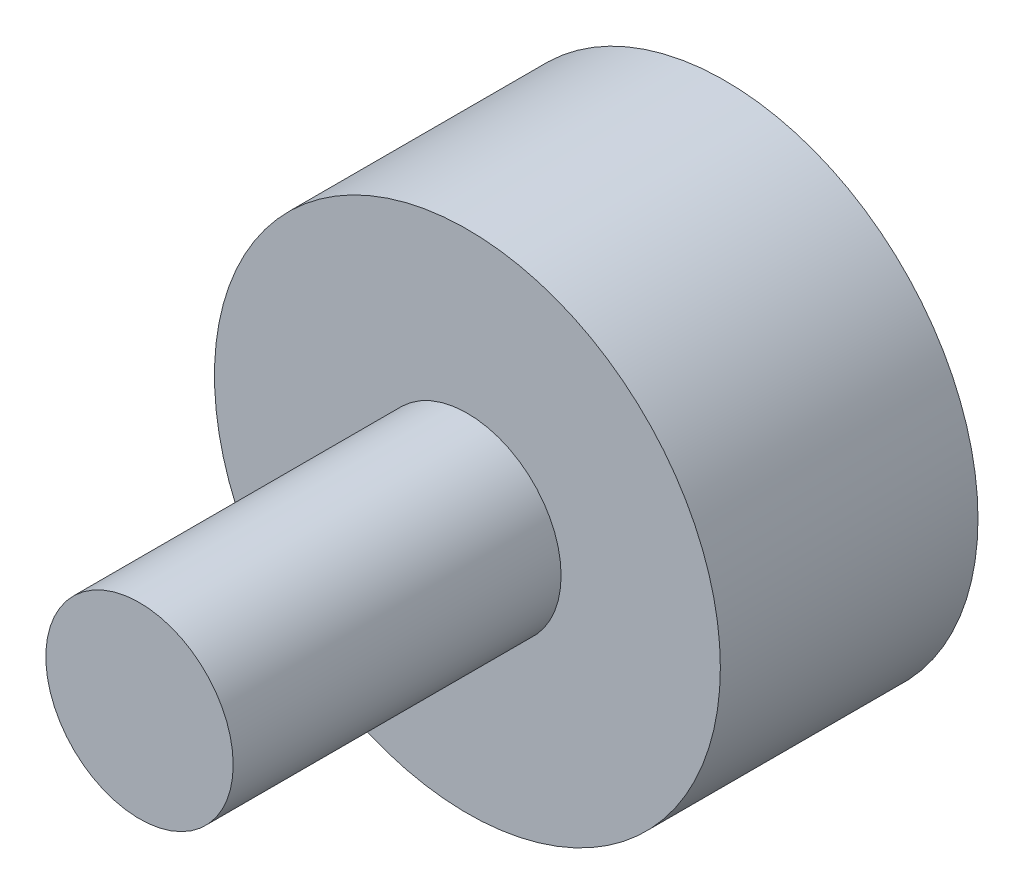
ISO-10303-21;
HEADER;
FILE_DESCRIPTION(('STEP AP214'),'2;1');
FILE_NAME('part.step','',(''),(''),'','','');
FILE_SCHEMA(('AUTOMOTIVE_DESIGN { 1 0 10303 214 1 1 1 1 }'));
ENDSEC;
DATA;
#1=APPLICATION_CONTEXT('core data for automotive mechanical design processes');
#2=APPLICATION_PROTOCOL_DEFINITION('international standard','automotive_design',2000,#1);
#3=PRODUCT_CONTEXT('',#1,'mechanical');
#4=PRODUCT('Part','Part','',(#3));
#5=PRODUCT_RELATED_PRODUCT_CATEGORY('part','',(#4));
#6=PRODUCT_DEFINITION_FORMATION('','',#4);
#7=PRODUCT_DEFINITION_CONTEXT('part definition',#1,'design');
#8=PRODUCT_DEFINITION('design','',#6,#7);
#9=PRODUCT_DEFINITION_SHAPE('','',#8);
#10=(LENGTH_UNIT() NAMED_UNIT(*) SI_UNIT(.MILLI.,.METRE.));
#11=(NAMED_UNIT(*) PLANE_ANGLE_UNIT() SI_UNIT($,.RADIAN.));
#12=(NAMED_UNIT(*) SI_UNIT($,.STERADIAN.) SOLID_ANGLE_UNIT());
#13=UNCERTAINTY_MEASURE_WITH_UNIT(LENGTH_MEASURE(1.E-05),#10,'distance_accuracy_value','');
#14=(GEOMETRIC_REPRESENTATION_CONTEXT(3) GLOBAL_UNCERTAINTY_ASSIGNED_CONTEXT((#13)) GLOBAL_UNIT_ASSIGNED_CONTEXT((#10,
#11,#12)) REPRESENTATION_CONTEXT('',''));
#15=CARTESIAN_POINT('',(0.,0.,0.));
#16=DIRECTION('',(0.,0.,1.));
#17=DIRECTION('',(1.,0.,0.));
#18=AXIS2_PLACEMENT_3D('',#15,#16,#17);
#19=CARTESIAN_POINT('',(0.,0.,22.));
#20=DIRECTION('',(0.,0.,1.));
#21=DIRECTION('',(1.,0.,0.));
#22=AXIS2_PLACEMENT_3D('',#19,#20,#21);
#23=PLANE('',#22);
#24=CARTESIAN_POINT('',(0.,0.,22.));
#25=DIRECTION('',(0.,0.,1.));
#26=DIRECTION('',(1.,0.,0.));
#27=AXIS2_PLACEMENT_3D('',#24,#25,#26);
#28=CIRCLE('',#27,21.6);
#29=CARTESIAN_POINT('',(21.6,0.,22.));
#30=VERTEX_POINT('',#29);
#31=EDGE_CURVE('E11',#30,#30,#28,.T.);
#32=ORIENTED_EDGE('',*,*,#31,.T.);
#33=EDGE_LOOP('',(#32));
#34=FACE_BOUND('',#33,.T.);
#35=CARTESIAN_POINT('',(0.,0.,22.));
#36=DIRECTION('',(0.,0.,1.));
#37=DIRECTION('',(1.,0.,0.));
#38=AXIS2_PLACEMENT_3D('',#35,#36,#37);
#39=CIRCLE('',#38,8.);
#40=CARTESIAN_POINT('',(8.,0.,22.));
#41=VERTEX_POINT('',#40);
#42=EDGE_CURVE('E48',#41,#41,#39,.T.);
#43=ORIENTED_EDGE('',*,*,#42,.F.);
#44=EDGE_LOOP('',(#43));
#45=FACE_BOUND('',#44,.T.);
#46=ADVANCED_FACE('F37',(#34,#45),#23,.T.);
#47=CARTESIAN_POINT('',(0.,0.,0.));
#48=DIRECTION('',(0.,0.,1.));
#49=DIRECTION('',(1.,0.,0.));
#50=AXIS2_PLACEMENT_3D('',#47,#48,#49);
#51=PLANE('',#50);
#52=CARTESIAN_POINT('',(0.,0.,0.));
#53=DIRECTION('',(0.,0.,1.));
#54=DIRECTION('',(1.,0.,0.));
#55=AXIS2_PLACEMENT_3D('',#52,#53,#54);
#56=CIRCLE('',#55,21.6);
#57=CARTESIAN_POINT('',(21.6,0.,0.));
#58=VERTEX_POINT('',#57);
#59=EDGE_CURVE('E41',#58,#58,#56,.T.);
#60=ORIENTED_EDGE('',*,*,#59,.F.);
#61=EDGE_LOOP('',(#60));
#62=FACE_BOUND('',#61,.T.);
#63=ADVANCED_FACE('F67',(#62),#51,.F.);
#64=CARTESIAN_POINT('',(0.,0.,22.));
#65=DIRECTION('',(0.,0.,-1.));
#66=DIRECTION('',(-1.,0.,0.));
#67=AXIS2_PLACEMENT_3D('',#64,#65,#66);
#68=CYLINDRICAL_SURFACE('',#67,21.6);
#69=ORIENTED_EDGE('',*,*,#31,.F.);
#70=EDGE_LOOP('',(#69));
#71=FACE_BOUND('',#70,.T.);
#72=ORIENTED_EDGE('',*,*,#59,.T.);
#73=EDGE_LOOP('',(#72));
#74=FACE_BOUND('',#73,.T.);
#75=ADVANCED_FACE('F39',(#71,#74),#68,.T.);
#76=CARTESIAN_POINT('',(0.,0.,50.));
#77=DIRECTION('',(0.,0.,-1.));
#78=DIRECTION('',(-1.,0.,0.));
#79=AXIS2_PLACEMENT_3D('',#76,#77,#78);
#80=CYLINDRICAL_SURFACE('',#79,8.);
#81=ORIENTED_EDGE('',*,*,#42,.T.);
#82=EDGE_LOOP('',(#81));
#83=FACE_BOUND('',#82,.T.);
#84=CARTESIAN_POINT('',(0.,0.,50.));
#85=DIRECTION('',(0.,0.,1.));
#86=DIRECTION('',(1.,0.,0.));
#87=AXIS2_PLACEMENT_3D('',#84,#85,#86);
#88=CIRCLE('',#87,8.);
#89=CARTESIAN_POINT('',(8.,0.,50.));
#90=VERTEX_POINT('',#89);
#91=EDGE_CURVE('E52',#90,#90,#88,.T.);
#92=ORIENTED_EDGE('',*,*,#91,.F.);
#93=EDGE_LOOP('',(#92));
#94=FACE_BOUND('',#93,.T.);
#95=ADVANCED_FACE('F58',(#83,#94),#80,.T.);
#96=CARTESIAN_POINT('',(0.,0.,50.));
#97=DIRECTION('',(0.,0.,1.));
#98=DIRECTION('',(1.,0.,0.));
#99=AXIS2_PLACEMENT_3D('',#96,#97,#98);
#100=PLANE('',#99);
#101=ORIENTED_EDGE('',*,*,#91,.T.);
#102=EDGE_LOOP('',(#101));
#103=FACE_BOUND('',#102,.T.);
#104=ADVANCED_FACE('F56',(#103),#100,.T.);
#105=CLOSED_SHELL('',(#46,#63,#75,#95,#104));
#106=MANIFOLD_SOLID_BREP('B2',#105);
#107=ADVANCED_BREP_SHAPE_REPRESENTATION('',(#18,#106),#14);
#108=SHAPE_DEFINITION_REPRESENTATION(#9,#107);
ENDSEC;
END-ISO-10303-21;
